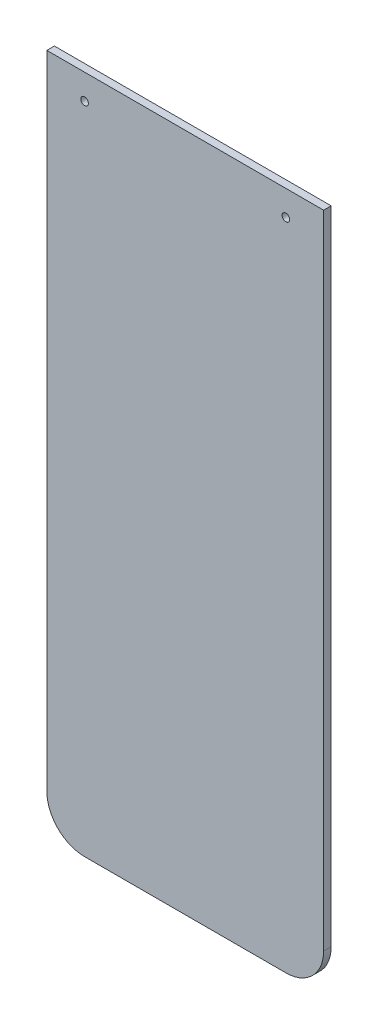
from build123d import *

# Parameters (mm, degrees)
SKETCH1_W           = 110
SKETCH1_H           = 270
SKETCH1_R           = 1.5
BOSS_EXTRUDE1_DEPTH = 3
FILLET1_R           = 15


with BuildPart() as part:
    # Sketch1 → Boss-Extrude1 (new body)
    with BuildSketch(Plane.XY):
        with Locations((0, -359)):
            Rectangle(SKETCH1_W, SKETCH1_H)
        with Locations((40, -234)):
            Circle(SKETCH1_R, mode=Mode.SUBTRACT)
        with Locations((-40, -234)):
            Circle(SKETCH1_R, mode=Mode.SUBTRACT)
    extrude(amount=BOSS_EXTRUDE1_DEPTH)

    # Fillet1
    fillet1_edges = [part.edges().sort_by_distance(p)[0] for p in [
        (55, -494, 1.5),
        (-55, -494, 1.5),
    ]]
    fillet(fillet1_edges, radius=FILLET1_R)


solid = part.part
